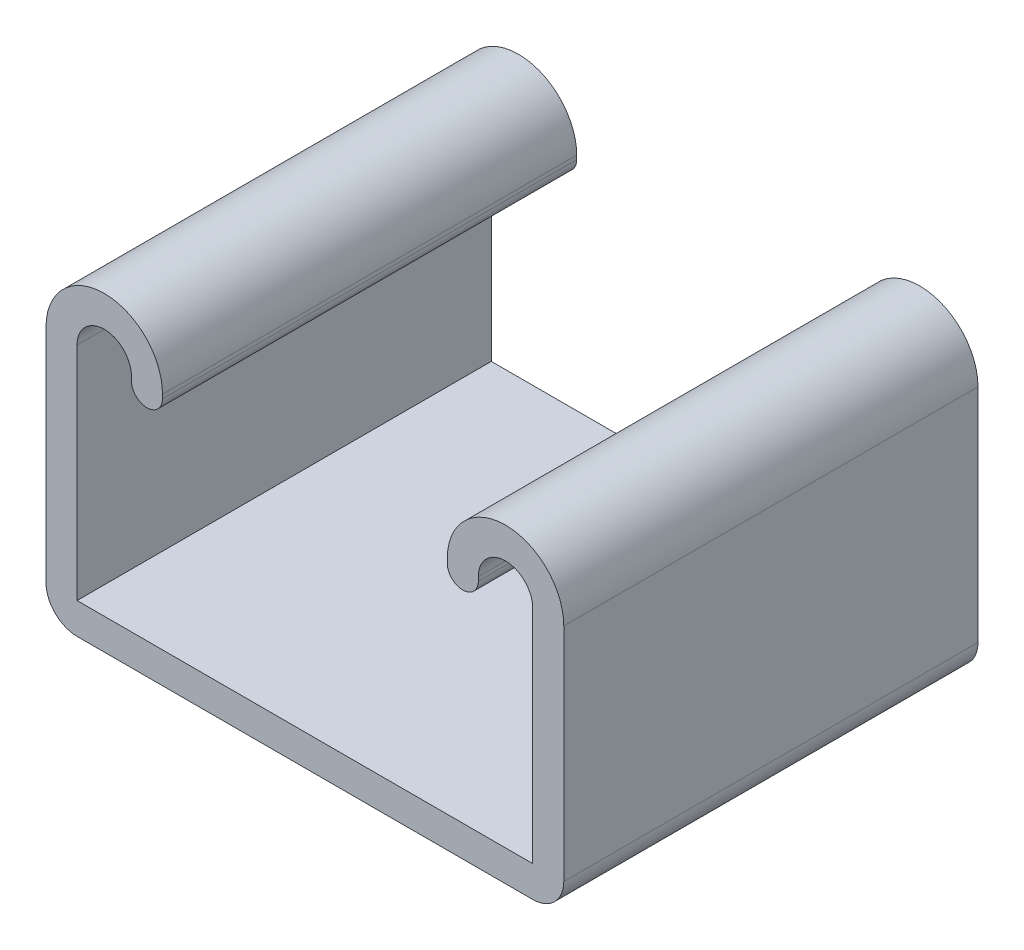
ISO-10303-21;
HEADER;
FILE_DESCRIPTION(('STEP AP214'),'2;1');
FILE_NAME('part.step','',(''),(''),'','','');
FILE_SCHEMA(('AUTOMOTIVE_DESIGN { 1 0 10303 214 1 1 1 1 }'));
ENDSEC;
DATA;
#1=APPLICATION_CONTEXT('core data for automotive mechanical design processes');
#2=APPLICATION_PROTOCOL_DEFINITION('international standard','automotive_design',2000,#1);
#3=PRODUCT_CONTEXT('',#1,'mechanical');
#4=PRODUCT('Part','Part','',(#3));
#5=PRODUCT_RELATED_PRODUCT_CATEGORY('part','',(#4));
#6=PRODUCT_DEFINITION_FORMATION('','',#4);
#7=PRODUCT_DEFINITION_CONTEXT('part definition',#1,'design');
#8=PRODUCT_DEFINITION('design','',#6,#7);
#9=PRODUCT_DEFINITION_SHAPE('','',#8);
#10=(LENGTH_UNIT() NAMED_UNIT(*) SI_UNIT(.MILLI.,.METRE.));
#11=(NAMED_UNIT(*) PLANE_ANGLE_UNIT() SI_UNIT($,.RADIAN.));
#12=(NAMED_UNIT(*) SI_UNIT($,.STERADIAN.) SOLID_ANGLE_UNIT());
#13=UNCERTAINTY_MEASURE_WITH_UNIT(LENGTH_MEASURE(1.E-05),#10,'distance_accuracy_value','');
#14=(GEOMETRIC_REPRESENTATION_CONTEXT(3) GLOBAL_UNCERTAINTY_ASSIGNED_CONTEXT((#13)) GLOBAL_UNIT_ASSIGNED_CONTEXT((#10,
#11,#12)) REPRESENTATION_CONTEXT('',''));
#15=CARTESIAN_POINT('',(0.,0.,0.));
#16=DIRECTION('',(0.,0.,1.));
#17=DIRECTION('',(1.,0.,0.));
#18=AXIS2_PLACEMENT_3D('',#15,#16,#17);
#19=CARTESIAN_POINT('',(-12.303125,7.604125,12.7));
#20=DIRECTION('',(0.,0.,-1.));
#21=DIRECTION('',(-1.,0.,0.));
#22=AXIS2_PLACEMENT_3D('',#19,#20,#21);
#23=CYLINDRICAL_SURFACE('',#22,3.571875);
#24=CARTESIAN_POINT('',(-12.303125,7.604125,-12.7));
#25=DIRECTION('',(0.,0.,1.));
#26=DIRECTION('',(-1.,0.,0.));
#27=AXIS2_PLACEMENT_3D('',#24,#25,#26);
#28=CIRCLE('',#27,3.571875);
#29=CARTESIAN_POINT('',(-8.73125,7.604125,-12.7));
#30=VERTEX_POINT('',#29);
#31=CARTESIAN_POINT('',(-15.875,7.604125,-12.7));
#32=VERTEX_POINT('',#31);
#33=EDGE_CURVE('E189',#30,#32,#28,.T.);
#34=ORIENTED_EDGE('',*,*,#33,.T.);
#35=DIRECTION('',(0.,0.,-1.));
#36=VECTOR('',#35,1.);
#37=CARTESIAN_POINT('',(-15.875,7.604125,12.7));
#38=LINE('',#37,#36);
#39=CARTESIAN_POINT('',(-15.875,7.604125,12.7));
#40=VERTEX_POINT('',#39);
#41=EDGE_CURVE('E11',#40,#32,#38,.T.);
#42=ORIENTED_EDGE('',*,*,#41,.F.);
#43=CARTESIAN_POINT('',(-12.303125,7.604125,12.7));
#44=DIRECTION('',(0.,0.,1.));
#45=DIRECTION('',(-1.,0.,0.));
#46=AXIS2_PLACEMENT_3D('',#43,#44,#45);
#47=CIRCLE('',#46,3.571875);
#48=CARTESIAN_POINT('',(-8.73125,7.604125,12.7));
#49=VERTEX_POINT('',#48);
#50=EDGE_CURVE('E223',#49,#40,#47,.T.);
#51=ORIENTED_EDGE('',*,*,#50,.F.);
#52=DIRECTION('',(0.,0.,-1.));
#53=VECTOR('',#52,1.);
#54=CARTESIAN_POINT('',(-8.73125,7.604125,12.7));
#55=LINE('',#54,#53);
#56=EDGE_CURVE('E185',#49,#30,#55,.T.);
#57=ORIENTED_EDGE('',*,*,#56,.T.);
#58=EDGE_LOOP('',(#34,#42,#51,#57));
#59=FACE_BOUND('',#58,.T.);
#60=ADVANCED_FACE('F33',(#59),#23,.T.);
#61=CARTESIAN_POINT('',(-15.875,7.604125,12.7));
#62=DIRECTION('',(1.,0.,0.));
#63=DIRECTION('',(0.,0.,-1.));
#64=AXIS2_PLACEMENT_3D('',#61,#62,#63);
#65=PLANE('',#64);
#66=DIRECTION('',(0.,-1.,0.));
#67=VECTOR('',#66,1.);
#68=CARTESIAN_POINT('',(-15.875,7.604125,-12.7));
#69=LINE('',#68,#67);
#70=CARTESIAN_POINT('',(-15.875,-5.969,-12.7));
#71=VERTEX_POINT('',#70);
#72=EDGE_CURVE('E192',#32,#71,#69,.T.);
#73=ORIENTED_EDGE('',*,*,#72,.T.);
#74=DIRECTION('',(0.,0.,-1.));
#75=VECTOR('',#74,1.);
#76=CARTESIAN_POINT('',(-15.875,-5.969,12.7));
#77=LINE('',#76,#75);
#78=CARTESIAN_POINT('',(-15.875,-5.969,12.7));
#79=VERTEX_POINT('',#78);
#80=EDGE_CURVE('E41',#79,#71,#77,.T.);
#81=ORIENTED_EDGE('',*,*,#80,.F.);
#82=DIRECTION('',(0.,-1.,0.));
#83=VECTOR('',#82,1.);
#84=CARTESIAN_POINT('',(-15.875,7.604125,12.7));
#85=LINE('',#84,#83);
#86=EDGE_CURVE('E122',#40,#79,#85,.T.);
#87=ORIENTED_EDGE('',*,*,#86,.F.);
#88=ORIENTED_EDGE('',*,*,#41,.T.);
#89=EDGE_LOOP('',(#73,#81,#87,#88));
#90=FACE_BOUND('',#89,.T.);
#91=ADVANCED_FACE('F331',(#90),#65,.F.);
#92=CARTESIAN_POINT('',(-13.97,-5.969,12.7));
#93=DIRECTION('',(0.,0.,-1.));
#94=DIRECTION('',(-1.,0.,0.));
#95=AXIS2_PLACEMENT_3D('',#92,#93,#94);
#96=CYLINDRICAL_SURFACE('',#95,1.905);
#97=CARTESIAN_POINT('',(-13.97,-5.969,-12.7));
#98=DIRECTION('',(0.,0.,1.));
#99=DIRECTION('',(-1.,0.,0.));
#100=AXIS2_PLACEMENT_3D('',#97,#98,#99);
#101=CIRCLE('',#100,1.905);
#102=CARTESIAN_POINT('',(-13.97,-7.874,-12.7));
#103=VERTEX_POINT('',#102);
#104=EDGE_CURVE('E194',#71,#103,#101,.T.);
#105=ORIENTED_EDGE('',*,*,#104,.T.);
#106=DIRECTION('',(0.,0.,-1.));
#107=VECTOR('',#106,1.);
#108=CARTESIAN_POINT('',(-13.97,-7.874,12.7));
#109=LINE('',#108,#107);
#110=CARTESIAN_POINT('',(-13.97,-7.874,12.7));
#111=VERTEX_POINT('',#110);
#112=EDGE_CURVE('E260',#111,#103,#109,.T.);
#113=ORIENTED_EDGE('',*,*,#112,.F.);
#114=CARTESIAN_POINT('',(-13.97,-5.969,12.7));
#115=DIRECTION('',(0.,0.,1.));
#116=DIRECTION('',(-1.,0.,0.));
#117=AXIS2_PLACEMENT_3D('',#114,#115,#116);
#118=CIRCLE('',#117,1.905);
#119=EDGE_CURVE('E268',#79,#111,#118,.T.);
#120=ORIENTED_EDGE('',*,*,#119,.F.);
#121=ORIENTED_EDGE('',*,*,#80,.T.);
#122=EDGE_LOOP('',(#105,#113,#120,#121));
#123=FACE_BOUND('',#122,.T.);
#124=ADVANCED_FACE('F266',(#123),#96,.T.);
#125=CARTESIAN_POINT('',(-13.97,-7.874,12.7));
#126=DIRECTION('',(0.,1.,0.));
#127=DIRECTION('',(0.,0.,1.));
#128=AXIS2_PLACEMENT_3D('',#125,#126,#127);
#129=PLANE('',#128);
#130=DIRECTION('',(1.,0.,0.));
#131=VECTOR('',#130,1.);
#132=CARTESIAN_POINT('',(-13.97,-7.874,-12.7));
#133=LINE('',#132,#131);
#134=CARTESIAN_POINT('',(13.97,-7.874,-12.7));
#135=VERTEX_POINT('',#134);
#136=EDGE_CURVE('E196',#103,#135,#133,.T.);
#137=ORIENTED_EDGE('',*,*,#136,.T.);
#138=DIRECTION('',(0.,0.,-1.));
#139=VECTOR('',#138,1.);
#140=CARTESIAN_POINT('',(13.97,-7.874,12.7));
#141=LINE('',#140,#139);
#142=CARTESIAN_POINT('',(13.97,-7.874,12.7));
#143=VERTEX_POINT('',#142);
#144=EDGE_CURVE('E257',#143,#135,#141,.T.);
#145=ORIENTED_EDGE('',*,*,#144,.F.);
#146=DIRECTION('',(1.,0.,0.));
#147=VECTOR('',#146,1.);
#148=CARTESIAN_POINT('',(-13.97,-7.874,12.7));
#149=LINE('',#148,#147);
#150=EDGE_CURVE('E286',#111,#143,#149,.T.);
#151=ORIENTED_EDGE('',*,*,#150,.F.);
#152=ORIENTED_EDGE('',*,*,#112,.T.);
#153=EDGE_LOOP('',(#137,#145,#151,#152));
#154=FACE_BOUND('',#153,.T.);
#155=ADVANCED_FACE('F277',(#154),#129,.F.);
#156=CARTESIAN_POINT('',(13.97,-5.969,12.7));
#157=DIRECTION('',(0.,0.,-1.));
#158=DIRECTION('',(-1.,0.,0.));
#159=AXIS2_PLACEMENT_3D('',#156,#157,#158);
#160=CYLINDRICAL_SURFACE('',#159,1.905);
#161=CARTESIAN_POINT('',(13.97,-5.969,-12.7));
#162=DIRECTION('',(0.,0.,1.));
#163=DIRECTION('',(1.,0.,0.));
#164=AXIS2_PLACEMENT_3D('',#161,#162,#163);
#165=CIRCLE('',#164,1.905);
#166=CARTESIAN_POINT('',(15.875,-5.969,-12.7));
#167=VERTEX_POINT('',#166);
#168=EDGE_CURVE('E198',#135,#167,#165,.T.);
#169=ORIENTED_EDGE('',*,*,#168,.T.);
#170=DIRECTION('',(0.,0.,-1.));
#171=VECTOR('',#170,1.);
#172=CARTESIAN_POINT('',(15.875,-5.969,12.7));
#173=LINE('',#172,#171);
#174=CARTESIAN_POINT('',(15.875,-5.969,12.7));
#175=VERTEX_POINT('',#174);
#176=EDGE_CURVE('E254',#175,#167,#173,.T.);
#177=ORIENTED_EDGE('',*,*,#176,.F.);
#178=CARTESIAN_POINT('',(13.97,-5.969,12.7));
#179=DIRECTION('',(0.,0.,1.));
#180=DIRECTION('',(1.,0.,0.));
#181=AXIS2_PLACEMENT_3D('',#178,#179,#180);
#182=CIRCLE('',#181,1.905);
#183=EDGE_CURVE('E283',#143,#175,#182,.T.);
#184=ORIENTED_EDGE('',*,*,#183,.F.);
#185=ORIENTED_EDGE('',*,*,#144,.T.);
#186=EDGE_LOOP('',(#169,#177,#184,#185));
#187=FACE_BOUND('',#186,.T.);
#188=ADVANCED_FACE('F281',(#187),#160,.T.);
#189=CARTESIAN_POINT('',(15.875,-5.969,12.7));
#190=DIRECTION('',(-1.,0.,0.));
#191=DIRECTION('',(0.,-1.,0.));
#192=AXIS2_PLACEMENT_3D('',#189,#190,#191);
#193=PLANE('',#192);
#194=DIRECTION('',(0.,1.,0.));
#195=VECTOR('',#194,1.);
#196=CARTESIAN_POINT('',(15.875,-5.969,-12.7));
#197=LINE('',#196,#195);
#198=CARTESIAN_POINT('',(15.875,7.604125,-12.7));
#199=VERTEX_POINT('',#198);
#200=EDGE_CURVE('E200',#167,#199,#197,.T.);
#201=ORIENTED_EDGE('',*,*,#200,.T.);
#202=DIRECTION('',(0.,0.,-1.));
#203=VECTOR('',#202,1.);
#204=CARTESIAN_POINT('',(15.875,7.604125,12.7));
#205=LINE('',#204,#203);
#206=CARTESIAN_POINT('',(15.875,7.604125,12.7));
#207=VERTEX_POINT('',#206);
#208=EDGE_CURVE('E251',#207,#199,#205,.T.);
#209=ORIENTED_EDGE('',*,*,#208,.F.);
#210=DIRECTION('',(0.,1.,0.));
#211=VECTOR('',#210,1.);
#212=CARTESIAN_POINT('',(15.875,-5.969,12.7));
#213=LINE('',#212,#211);
#214=EDGE_CURVE('E285',#175,#207,#213,.T.);
#215=ORIENTED_EDGE('',*,*,#214,.F.);
#216=ORIENTED_EDGE('',*,*,#176,.T.);
#217=EDGE_LOOP('',(#201,#209,#215,#216));
#218=FACE_BOUND('',#217,.T.);
#219=ADVANCED_FACE('F344',(#218),#193,.F.);
#220=CARTESIAN_POINT('',(12.303125,7.604125,12.7));
#221=DIRECTION('',(0.,0.,-1.));
#222=DIRECTION('',(-1.,0.,0.));
#223=AXIS2_PLACEMENT_3D('',#220,#221,#222);
#224=CYLINDRICAL_SURFACE('',#223,3.571875);
#225=CARTESIAN_POINT('',(12.303125,7.604125,-12.7));
#226=DIRECTION('',(0.,0.,1.));
#227=DIRECTION('',(1.,0.,0.));
#228=AXIS2_PLACEMENT_3D('',#225,#226,#227);
#229=CIRCLE('',#228,3.571875);
#230=CARTESIAN_POINT('',(8.73125,7.604125,-12.7));
#231=VERTEX_POINT('',#230);
#232=EDGE_CURVE('E202',#199,#231,#229,.T.);
#233=ORIENTED_EDGE('',*,*,#232,.T.);
#234=DIRECTION('',(0.,0.,-1.));
#235=VECTOR('',#234,1.);
#236=CARTESIAN_POINT('',(8.73125,7.604125,12.7));
#237=LINE('',#236,#235);
#238=CARTESIAN_POINT('',(8.73125,7.604125,12.7));
#239=VERTEX_POINT('',#238);
#240=EDGE_CURVE('E248',#239,#231,#237,.T.);
#241=ORIENTED_EDGE('',*,*,#240,.F.);
#242=CARTESIAN_POINT('',(12.303125,7.604125,12.7));
#243=DIRECTION('',(0.,0.,1.));
#244=DIRECTION('',(1.,0.,0.));
#245=AXIS2_PLACEMENT_3D('',#242,#243,#244);
#246=CIRCLE('',#245,3.571875);
#247=EDGE_CURVE('E288',#207,#239,#246,.T.);
#248=ORIENTED_EDGE('',*,*,#247,.F.);
#249=ORIENTED_EDGE('',*,*,#208,.T.);
#250=EDGE_LOOP('',(#233,#241,#248,#249));
#251=FACE_BOUND('',#250,.T.);
#252=ADVANCED_FACE('F347',(#251),#224,.T.);
#253=CARTESIAN_POINT('',(8.73125,7.604125,12.7));
#254=DIRECTION('',(1.,0.,0.));
#255=DIRECTION('',(0.,0.,-1.));
#256=AXIS2_PLACEMENT_3D('',#253,#254,#255);
#257=PLANE('',#256);
#258=DIRECTION('',(0.,-1.,0.));
#259=VECTOR('',#258,1.);
#260=CARTESIAN_POINT('',(8.73125,7.604125,-12.7));
#261=LINE('',#260,#259);
#262=CARTESIAN_POINT('',(8.73125,7.366,-12.7));
#263=VERTEX_POINT('',#262);
#264=EDGE_CURVE('E204',#231,#263,#261,.T.);
#265=ORIENTED_EDGE('',*,*,#264,.T.);
#266=DIRECTION('',(0.,0.,-1.));
#267=VECTOR('',#266,1.);
#268=CARTESIAN_POINT('',(8.73125,7.366,12.7));
#269=LINE('',#268,#267);
#270=CARTESIAN_POINT('',(8.73125,7.366,12.7));
#271=VERTEX_POINT('',#270);
#272=EDGE_CURVE('E245',#271,#263,#269,.T.);
#273=ORIENTED_EDGE('',*,*,#272,.F.);
#274=DIRECTION('',(0.,-1.,0.));
#275=VECTOR('',#274,1.);
#276=CARTESIAN_POINT('',(8.73125,7.604125,12.7));
#277=LINE('',#276,#275);
#278=EDGE_CURVE('E294',#239,#271,#277,.T.);
#279=ORIENTED_EDGE('',*,*,#278,.F.);
#280=ORIENTED_EDGE('',*,*,#240,.T.);
#281=EDGE_LOOP('',(#265,#273,#279,#280));
#282=FACE_BOUND('',#281,.T.);
#283=ADVANCED_FACE('F351',(#282),#257,.F.);
#284=CARTESIAN_POINT('',(9.68375,7.366,12.7));
#285=DIRECTION('',(0.,0.,-1.));
#286=DIRECTION('',(-1.,0.,0.));
#287=AXIS2_PLACEMENT_3D('',#284,#285,#286);
#288=CYLINDRICAL_SURFACE('',#287,0.9525);
#289=CARTESIAN_POINT('',(9.68375,7.366,-12.7));
#290=DIRECTION('',(0.,0.,1.));
#291=DIRECTION('',(1.,0.,0.));
#292=AXIS2_PLACEMENT_3D('',#289,#290,#291);
#293=CIRCLE('',#292,0.9525);
#294=CARTESIAN_POINT('',(10.63625,7.366,-12.7));
#295=VERTEX_POINT('',#294);
#296=EDGE_CURVE('E206',#263,#295,#293,.T.);
#297=ORIENTED_EDGE('',*,*,#296,.T.);
#298=DIRECTION('',(0.,0.,-1.));
#299=VECTOR('',#298,1.);
#300=CARTESIAN_POINT('',(10.63625,7.366,12.7));
#301=LINE('',#300,#299);
#302=CARTESIAN_POINT('',(10.63625,7.366,12.7));
#303=VERTEX_POINT('',#302);
#304=EDGE_CURVE('E242',#303,#295,#301,.T.);
#305=ORIENTED_EDGE('',*,*,#304,.F.);
#306=CARTESIAN_POINT('',(9.68375,7.366,12.7));
#307=DIRECTION('',(0.,0.,1.));
#308=DIRECTION('',(1.,0.,0.));
#309=AXIS2_PLACEMENT_3D('',#306,#307,#308);
#310=CIRCLE('',#309,0.9525);
#311=EDGE_CURVE('E296',#271,#303,#310,.T.);
#312=ORIENTED_EDGE('',*,*,#311,.F.);
#313=ORIENTED_EDGE('',*,*,#272,.T.);
#314=EDGE_LOOP('',(#297,#305,#312,#313));
#315=FACE_BOUND('',#314,.T.);
#316=ADVANCED_FACE('F355',(#315),#288,.T.);
#317=CARTESIAN_POINT('',(10.63625,7.604125,12.7));
#318=DIRECTION('',(-1.,0.,0.));
#319=DIRECTION('',(0.,0.,1.));
#320=AXIS2_PLACEMENT_3D('',#317,#318,#319);
#321=PLANE('',#320);
#322=DIRECTION('',(0.,1.,0.));
#323=VECTOR('',#322,1.);
#324=CARTESIAN_POINT('',(10.63625,7.604125,-12.7));
#325=LINE('',#324,#323);
#326=CARTESIAN_POINT('',(10.63625,7.604125,-12.7));
#327=VERTEX_POINT('',#326);
#328=EDGE_CURVE('E208',#295,#327,#325,.T.);
#329=ORIENTED_EDGE('',*,*,#328,.T.);
#330=DIRECTION('',(0.,0.,-1.));
#331=VECTOR('',#330,1.);
#332=CARTESIAN_POINT('',(10.63625,7.604125,12.7));
#333=LINE('',#332,#331);
#334=CARTESIAN_POINT('',(10.63625,7.604125,12.7));
#335=VERTEX_POINT('',#334);
#336=EDGE_CURVE('E239',#335,#327,#333,.T.);
#337=ORIENTED_EDGE('',*,*,#336,.F.);
#338=DIRECTION('',(0.,1.,0.));
#339=VECTOR('',#338,1.);
#340=CARTESIAN_POINT('',(10.63625,7.604125,12.7));
#341=LINE('',#340,#339);
#342=EDGE_CURVE('E298',#303,#335,#341,.T.);
#343=ORIENTED_EDGE('',*,*,#342,.F.);
#344=ORIENTED_EDGE('',*,*,#304,.T.);
#345=EDGE_LOOP('',(#329,#337,#343,#344));
#346=FACE_BOUND('',#345,.T.);
#347=ADVANCED_FACE('F359',(#346),#321,.F.);
#348=CARTESIAN_POINT('',(12.303125,7.604125,12.7));
#349=DIRECTION('',(0.,0.,-1.));
#350=DIRECTION('',(-1.,0.,0.));
#351=AXIS2_PLACEMENT_3D('',#348,#349,#350);
#352=CYLINDRICAL_SURFACE('',#351,1.666875);
#353=CARTESIAN_POINT('',(12.303125,7.604125,-12.7));
#354=DIRECTION('',(0.,0.,-1.));
#355=DIRECTION('',(1.,0.,0.));
#356=AXIS2_PLACEMENT_3D('',#353,#354,#355);
#357=CIRCLE('',#356,1.666875);
#358=CARTESIAN_POINT('',(13.97,7.604125,-12.7));
#359=VERTEX_POINT('',#358);
#360=EDGE_CURVE('E210',#327,#359,#357,.T.);
#361=ORIENTED_EDGE('',*,*,#360,.T.);
#362=DIRECTION('',(0.,0.,-1.));
#363=VECTOR('',#362,1.);
#364=CARTESIAN_POINT('',(13.97,7.604125,12.7));
#365=LINE('',#364,#363);
#366=CARTESIAN_POINT('',(13.97,7.604125,12.7));
#367=VERTEX_POINT('',#366);
#368=EDGE_CURVE('E236',#367,#359,#365,.T.);
#369=ORIENTED_EDGE('',*,*,#368,.F.);
#370=CARTESIAN_POINT('',(12.303125,7.604125,12.7));
#371=DIRECTION('',(0.,0.,-1.));
#372=DIRECTION('',(1.,0.,0.));
#373=AXIS2_PLACEMENT_3D('',#370,#371,#372);
#374=CIRCLE('',#373,1.666875);
#375=EDGE_CURVE('E300',#335,#367,#374,.T.);
#376=ORIENTED_EDGE('',*,*,#375,.F.);
#377=ORIENTED_EDGE('',*,*,#336,.T.);
#378=EDGE_LOOP('',(#361,#369,#376,#377));
#379=FACE_BOUND('',#378,.T.);
#380=ADVANCED_FACE('F363',(#379),#352,.F.);
#381=CARTESIAN_POINT('',(13.97,-5.969,12.7));
#382=DIRECTION('',(1.,0.,0.));
#383=DIRECTION('',(0.,1.,0.));
#384=AXIS2_PLACEMENT_3D('',#381,#382,#383);
#385=PLANE('',#384);
#386=DIRECTION('',(0.,-1.,0.));
#387=VECTOR('',#386,1.);
#388=CARTESIAN_POINT('',(13.97,-5.969,-12.7));
#389=LINE('',#388,#387);
#390=CARTESIAN_POINT('',(13.97,-5.969,-12.7));
#391=VERTEX_POINT('',#390);
#392=EDGE_CURVE('E212',#359,#391,#389,.T.);
#393=ORIENTED_EDGE('',*,*,#392,.T.);
#394=DIRECTION('',(0.,0.,-1.));
#395=VECTOR('',#394,1.);
#396=CARTESIAN_POINT('',(13.97,-5.969,12.7));
#397=LINE('',#396,#395);
#398=CARTESIAN_POINT('',(13.97,-5.969,12.7));
#399=VERTEX_POINT('',#398);
#400=EDGE_CURVE('E233',#399,#391,#397,.T.);
#401=ORIENTED_EDGE('',*,*,#400,.F.);
#402=DIRECTION('',(0.,-1.,0.));
#403=VECTOR('',#402,1.);
#404=CARTESIAN_POINT('',(13.97,-5.969,12.7));
#405=LINE('',#404,#403);
#406=EDGE_CURVE('E302',#367,#399,#405,.T.);
#407=ORIENTED_EDGE('',*,*,#406,.F.);
#408=ORIENTED_EDGE('',*,*,#368,.T.);
#409=EDGE_LOOP('',(#393,#401,#407,#408));
#410=FACE_BOUND('',#409,.T.);
#411=ADVANCED_FACE('F367',(#410),#385,.F.);
#412=CARTESIAN_POINT('',(-13.97,-5.969,12.7));
#413=DIRECTION('',(0.,-1.,0.));
#414=DIRECTION('',(0.,0.,-1.));
#415=AXIS2_PLACEMENT_3D('',#412,#413,#414);
#416=PLANE('',#415);
#417=DIRECTION('',(-1.,0.,0.));
#418=VECTOR('',#417,1.);
#419=CARTESIAN_POINT('',(-13.97,-5.969,-12.7));
#420=LINE('',#419,#418);
#421=CARTESIAN_POINT('',(-13.97,-5.969,-12.7));
#422=VERTEX_POINT('',#421);
#423=EDGE_CURVE('E214',#391,#422,#420,.T.);
#424=ORIENTED_EDGE('',*,*,#423,.T.);
#425=DIRECTION('',(0.,0.,-1.));
#426=VECTOR('',#425,1.);
#427=CARTESIAN_POINT('',(-13.97,-5.969,12.7));
#428=LINE('',#427,#426);
#429=CARTESIAN_POINT('',(-13.97,-5.969,12.7));
#430=VERTEX_POINT('',#429);
#431=EDGE_CURVE('E230',#430,#422,#428,.T.);
#432=ORIENTED_EDGE('',*,*,#431,.F.);
#433=DIRECTION('',(-1.,0.,0.));
#434=VECTOR('',#433,1.);
#435=CARTESIAN_POINT('',(-13.97,-5.969,12.7));
#436=LINE('',#435,#434);
#437=EDGE_CURVE('E304',#399,#430,#436,.T.);
#438=ORIENTED_EDGE('',*,*,#437,.F.);
#439=ORIENTED_EDGE('',*,*,#400,.T.);
#440=EDGE_LOOP('',(#424,#432,#438,#439));
#441=FACE_BOUND('',#440,.T.);
#442=ADVANCED_FACE('F371',(#441),#416,.F.);
#443=CARTESIAN_POINT('',(-13.97,7.604125,12.7));
#444=DIRECTION('',(-1.,0.,0.));
#445=DIRECTION('',(0.,-1.,0.));
#446=AXIS2_PLACEMENT_3D('',#443,#444,#445);
#447=PLANE('',#446);
#448=DIRECTION('',(0.,1.,0.));
#449=VECTOR('',#448,1.);
#450=CARTESIAN_POINT('',(-13.97,7.604125,-12.7));
#451=LINE('',#450,#449);
#452=CARTESIAN_POINT('',(-13.97,7.604125,-12.7));
#453=VERTEX_POINT('',#452);
#454=EDGE_CURVE('E216',#422,#453,#451,.T.);
#455=ORIENTED_EDGE('',*,*,#454,.T.);
#456=DIRECTION('',(0.,0.,-1.));
#457=VECTOR('',#456,1.);
#458=CARTESIAN_POINT('',(-13.97,7.604125,12.7));
#459=LINE('',#458,#457);
#460=CARTESIAN_POINT('',(-13.97,7.604125,12.7));
#461=VERTEX_POINT('',#460);
#462=EDGE_CURVE('E227',#461,#453,#459,.T.);
#463=ORIENTED_EDGE('',*,*,#462,.F.);
#464=DIRECTION('',(0.,1.,0.));
#465=VECTOR('',#464,1.);
#466=CARTESIAN_POINT('',(-13.97,7.604125,12.7));
#467=LINE('',#466,#465);
#468=EDGE_CURVE('E306',#430,#461,#467,.T.);
#469=ORIENTED_EDGE('',*,*,#468,.F.);
#470=ORIENTED_EDGE('',*,*,#431,.T.);
#471=EDGE_LOOP('',(#455,#463,#469,#470));
#472=FACE_BOUND('',#471,.T.);
#473=ADVANCED_FACE('F312',(#472),#447,.F.);
#474=CARTESIAN_POINT('',(-12.303125,7.604125,12.7));
#475=DIRECTION('',(0.,0.,-1.));
#476=DIRECTION('',(-1.,0.,0.));
#477=AXIS2_PLACEMENT_3D('',#474,#475,#476);
#478=CYLINDRICAL_SURFACE('',#477,1.666875);
#479=CARTESIAN_POINT('',(-12.303125,7.604125,-12.7));
#480=DIRECTION('',(0.,0.,-1.));
#481=DIRECTION('',(-1.,0.,0.));
#482=AXIS2_PLACEMENT_3D('',#479,#480,#481);
#483=CIRCLE('',#482,1.666875);
#484=CARTESIAN_POINT('',(-10.63625,7.604125,-12.7));
#485=VERTEX_POINT('',#484);
#486=EDGE_CURVE('E218',#453,#485,#483,.T.);
#487=ORIENTED_EDGE('',*,*,#486,.T.);
#488=DIRECTION('',(0.,0.,-1.));
#489=VECTOR('',#488,1.);
#490=CARTESIAN_POINT('',(-10.63625,7.604125,12.7));
#491=LINE('',#490,#489);
#492=CARTESIAN_POINT('',(-10.63625,7.604125,12.7));
#493=VERTEX_POINT('',#492);
#494=EDGE_CURVE('E180',#493,#485,#491,.T.);
#495=ORIENTED_EDGE('',*,*,#494,.F.);
#496=CARTESIAN_POINT('',(-12.303125,7.604125,12.7));
#497=DIRECTION('',(0.,0.,-1.));
#498=DIRECTION('',(-1.,0.,0.));
#499=AXIS2_PLACEMENT_3D('',#496,#497,#498);
#500=CIRCLE('',#499,1.666875);
#501=EDGE_CURVE('E171',#461,#493,#500,.T.);
#502=ORIENTED_EDGE('',*,*,#501,.F.);
#503=ORIENTED_EDGE('',*,*,#462,.T.);
#504=EDGE_LOOP('',(#487,#495,#502,#503));
#505=FACE_BOUND('',#504,.T.);
#506=ADVANCED_FACE('F316',(#505),#478,.F.);
#507=CARTESIAN_POINT('',(-10.63625,7.604125,12.7));
#508=DIRECTION('',(1.,0.,0.));
#509=DIRECTION('',(0.,1.,0.));
#510=AXIS2_PLACEMENT_3D('',#507,#508,#509);
#511=PLANE('',#510);
#512=DIRECTION('',(0.,-1.,0.));
#513=VECTOR('',#512,1.);
#514=CARTESIAN_POINT('',(-10.63625,7.604125,-12.7));
#515=LINE('',#514,#513);
#516=CARTESIAN_POINT('',(-10.63625,7.366,-12.7));
#517=VERTEX_POINT('',#516);
#518=EDGE_CURVE('E179',#485,#517,#515,.T.);
#519=ORIENTED_EDGE('',*,*,#518,.T.);
#520=DIRECTION('',(0.,0.,-1.));
#521=VECTOR('',#520,1.);
#522=CARTESIAN_POINT('',(-10.63625,7.366,12.7));
#523=LINE('',#522,#521);
#524=CARTESIAN_POINT('',(-10.63625,7.366,12.7));
#525=VERTEX_POINT('',#524);
#526=EDGE_CURVE('E176',#525,#517,#523,.T.);
#527=ORIENTED_EDGE('',*,*,#526,.F.);
#528=DIRECTION('',(0.,-1.,0.));
#529=VECTOR('',#528,1.);
#530=CARTESIAN_POINT('',(-10.63625,7.604125,12.7));
#531=LINE('',#530,#529);
#532=EDGE_CURVE('E165',#493,#525,#531,.T.);
#533=ORIENTED_EDGE('',*,*,#532,.F.);
#534=ORIENTED_EDGE('',*,*,#494,.T.);
#535=EDGE_LOOP('',(#519,#527,#533,#534));
#536=FACE_BOUND('',#535,.T.);
#537=ADVANCED_FACE('F177',(#536),#511,.F.);
#538=CARTESIAN_POINT('',(-9.68375,7.366,12.7));
#539=DIRECTION('',(0.,0.,-1.));
#540=DIRECTION('',(-1.,0.,0.));
#541=AXIS2_PLACEMENT_3D('',#538,#539,#540);
#542=CYLINDRICAL_SURFACE('',#541,0.952500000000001);
#543=CARTESIAN_POINT('',(-9.68375,7.366,-12.7));
#544=DIRECTION('',(0.,0.,1.));
#545=DIRECTION('',(-1.,0.,0.));
#546=AXIS2_PLACEMENT_3D('',#543,#544,#545);
#547=CIRCLE('',#546,0.952500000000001);
#548=CARTESIAN_POINT('',(-8.73125,7.366,-12.7));
#549=VERTEX_POINT('',#548);
#550=EDGE_CURVE('E108',#517,#549,#547,.T.);
#551=ORIENTED_EDGE('',*,*,#550,.T.);
#552=DIRECTION('',(0.,0.,-1.));
#553=VECTOR('',#552,1.);
#554=CARTESIAN_POINT('',(-8.73125,7.366,12.7));
#555=LINE('',#554,#553);
#556=CARTESIAN_POINT('',(-8.73125,7.366,12.7));
#557=VERTEX_POINT('',#556);
#558=EDGE_CURVE('E181',#557,#549,#555,.T.);
#559=ORIENTED_EDGE('',*,*,#558,.F.);
#560=CARTESIAN_POINT('',(-9.68375,7.366,12.7));
#561=DIRECTION('',(0.,0.,1.));
#562=DIRECTION('',(-1.,0.,0.));
#563=AXIS2_PLACEMENT_3D('',#560,#561,#562);
#564=CIRCLE('',#563,0.952500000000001);
#565=EDGE_CURVE('E169',#525,#557,#564,.T.);
#566=ORIENTED_EDGE('',*,*,#565,.F.);
#567=ORIENTED_EDGE('',*,*,#526,.T.);
#568=EDGE_LOOP('',(#551,#559,#566,#567));
#569=FACE_BOUND('',#568,.T.);
#570=ADVANCED_FACE('F183',(#569),#542,.T.);
#571=CARTESIAN_POINT('',(-8.73125,7.604125,12.7));
#572=DIRECTION('',(-1.,0.,0.));
#573=DIRECTION('',(0.,-1.,0.));
#574=AXIS2_PLACEMENT_3D('',#571,#572,#573);
#575=PLANE('',#574);
#576=DIRECTION('',(0.,1.,0.));
#577=VECTOR('',#576,1.);
#578=CARTESIAN_POINT('',(-8.73125,7.604125,-12.7));
#579=LINE('',#578,#577);
#580=EDGE_CURVE('E114',#549,#30,#579,.T.);
#581=ORIENTED_EDGE('',*,*,#580,.T.);
#582=ORIENTED_EDGE('',*,*,#56,.F.);
#583=DIRECTION('',(0.,1.,0.));
#584=VECTOR('',#583,1.);
#585=CARTESIAN_POINT('',(-8.73125,7.604125,12.7));
#586=LINE('',#585,#584);
#587=EDGE_CURVE('E49',#557,#49,#586,.T.);
#588=ORIENTED_EDGE('',*,*,#587,.F.);
#589=ORIENTED_EDGE('',*,*,#558,.T.);
#590=EDGE_LOOP('',(#581,#582,#588,#589));
#591=FACE_BOUND('',#590,.T.);
#592=ADVANCED_FACE('F320',(#591),#575,.F.);
#593=CARTESIAN_POINT('',(-12.303125,7.604125,12.7));
#594=DIRECTION('',(0.,0.,-1.));
#595=DIRECTION('',(-1.,0.,0.));
#596=AXIS2_PLACEMENT_3D('',#593,#594,#595);
#597=PLANE('',#596);
#598=ORIENTED_EDGE('',*,*,#50,.T.);
#599=ORIENTED_EDGE('',*,*,#86,.T.);
#600=ORIENTED_EDGE('',*,*,#119,.T.);
#601=ORIENTED_EDGE('',*,*,#150,.T.);
#602=ORIENTED_EDGE('',*,*,#183,.T.);
#603=ORIENTED_EDGE('',*,*,#214,.T.);
#604=ORIENTED_EDGE('',*,*,#247,.T.);
#605=ORIENTED_EDGE('',*,*,#278,.T.);
#606=ORIENTED_EDGE('',*,*,#311,.T.);
#607=ORIENTED_EDGE('',*,*,#342,.T.);
#608=ORIENTED_EDGE('',*,*,#375,.T.);
#609=ORIENTED_EDGE('',*,*,#406,.T.);
#610=ORIENTED_EDGE('',*,*,#437,.T.);
#611=ORIENTED_EDGE('',*,*,#468,.T.);
#612=ORIENTED_EDGE('',*,*,#501,.T.);
#613=ORIENTED_EDGE('',*,*,#532,.T.);
#614=ORIENTED_EDGE('',*,*,#565,.T.);
#615=ORIENTED_EDGE('',*,*,#587,.T.);
#616=EDGE_LOOP('',(#598,#599,#600,#601,#602,#603,#604,#605,#606,#607,#608,#609,#610,#611,#612,
#613,#614,#615));
#617=FACE_BOUND('',#616,.T.);
#618=ADVANCED_FACE('F167',(#617),#597,.F.);
#619=CARTESIAN_POINT('',(-12.303125,7.604125,-12.7));
#620=DIRECTION('',(0.,0.,-1.));
#621=DIRECTION('',(-1.,0.,0.));
#622=AXIS2_PLACEMENT_3D('',#619,#620,#621);
#623=PLANE('',#622);
#624=ORIENTED_EDGE('',*,*,#33,.F.);
#625=ORIENTED_EDGE('',*,*,#580,.F.);
#626=ORIENTED_EDGE('',*,*,#550,.F.);
#627=ORIENTED_EDGE('',*,*,#518,.F.);
#628=ORIENTED_EDGE('',*,*,#486,.F.);
#629=ORIENTED_EDGE('',*,*,#454,.F.);
#630=ORIENTED_EDGE('',*,*,#423,.F.);
#631=ORIENTED_EDGE('',*,*,#392,.F.);
#632=ORIENTED_EDGE('',*,*,#360,.F.);
#633=ORIENTED_EDGE('',*,*,#328,.F.);
#634=ORIENTED_EDGE('',*,*,#296,.F.);
#635=ORIENTED_EDGE('',*,*,#264,.F.);
#636=ORIENTED_EDGE('',*,*,#232,.F.);
#637=ORIENTED_EDGE('',*,*,#200,.F.);
#638=ORIENTED_EDGE('',*,*,#168,.F.);
#639=ORIENTED_EDGE('',*,*,#136,.F.);
#640=ORIENTED_EDGE('',*,*,#104,.F.);
#641=ORIENTED_EDGE('',*,*,#72,.F.);
#642=EDGE_LOOP('',(#624,#625,#626,#627,#628,#629,#630,#631,#632,#633,#634,#635,#636,#637,#638,
#639,#640,#641));
#643=FACE_BOUND('',#642,.T.);
#644=ADVANCED_FACE('F272',(#643),#623,.T.);
#645=CLOSED_SHELL('',(#60,#91,#124,#155,#188,#219,#252,#283,#316,#347,#380,#411,#442,#473,#506,
#537,#570,#592,#618,#644));
#646=MANIFOLD_SOLID_BREP('B2',#645);
#647=ADVANCED_BREP_SHAPE_REPRESENTATION('',(#18,#646),#14);
#648=SHAPE_DEFINITION_REPRESENTATION(#9,#647);
ENDSEC;
END-ISO-10303-21;
